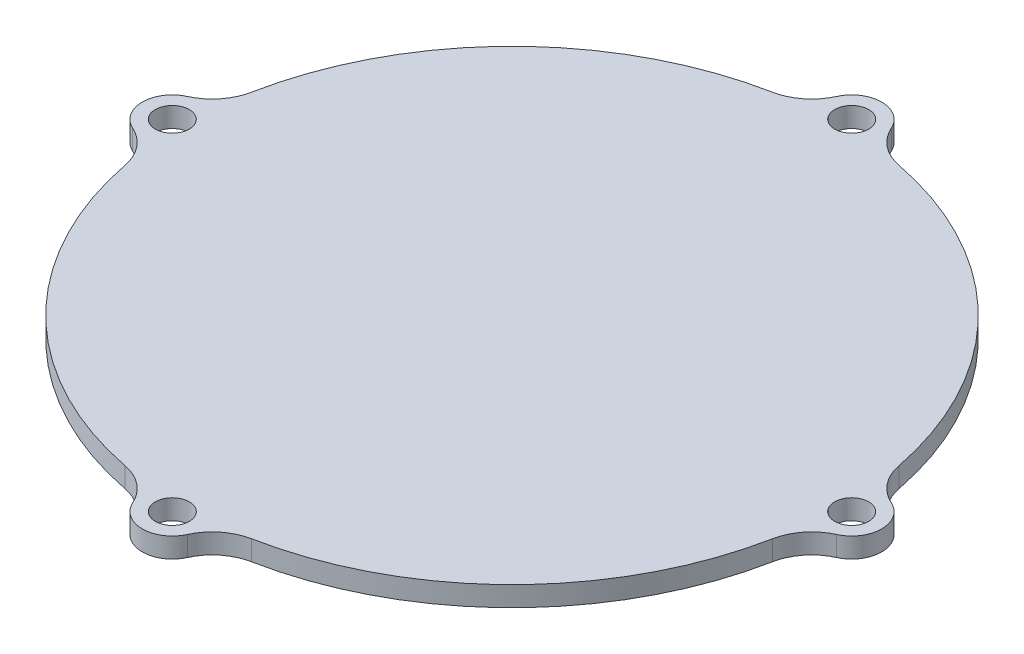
from build123d import *

# Parameters (mm, degrees)
SKETCH1_R                = 33
BOSS_EXTRUDE1_DEPTH      = 2
SKETCH2_R                = 3
BOSS_EXTRUDE2_DEPTH      = 2
FILLET1_R                = 5
CIRPATTERN1_COUNT        = 4
FILLET1_OF_CIRPATTERN1_R = 5
M3_CLEARANCE_HOLE1_D     = 3.4


with BuildPart() as part:
    # Sketch1 → Boss-Extrude1 (new body)
    with BuildSketch(Plane(origin=(0, 0, 0), x_dir=(1, 0, 0), z_dir=(0, 1, 0))):
        with Locations(Location((0, 0, 0), (0, 0, 270))):
            Circle(SKETCH1_R)
    extrude(amount=BOSS_EXTRUDE1_DEPTH)

    # Sketch2 → Boss-Extrude2 (add, through all)
    with BuildSketch(Plane(origin=(0, 2, 0), x_dir=(1, 0, 0), z_dir=(0, 1, 0))):
        with Locations((0, 34)):
            Circle(SKETCH2_R)
    boss_extrude2 = extrude(amount=-BOSS_EXTRUDE2_DEPTH)

    # Fillet1
    fillet1_edges = [part.edges().sort_by_distance(p)[0] for p in [
        (2.784037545, 1, -32.882352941),
        (-2.784037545, 1, -32.882352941),
    ]]
    fillet(fillet1_edges, radius=FILLET1_R)

    # CirPattern1: Boss-Extrude2 ×4 about axis
    cirpattern1_axis = Axis((0, 0, 0), (0, 1, 0))
    for i in range(1, CIRPATTERN1_COUNT):
        add(boss_extrude2.rotate(cirpattern1_axis, i * 360 / CIRPATTERN1_COUNT))

    # Fillet1 of CirPattern1
    fillet1_of_cirpattern1_edges = [part.edges().sort_by_distance(p)[0] for p in [
        (-32.882352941, 1, -2.784037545),
        (-32.882352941, 1, 2.784037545),
        (-2.784037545, 1, 32.882352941),
        (2.784037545, 1, 32.882352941),
        (32.882352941, 1, 2.784037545),
        (32.882352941, 1, -2.784037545),
    ]]
    fillet(fillet1_of_cirpattern1_edges, radius=FILLET1_OF_CIRPATTERN1_R)

    # M3 Clearance Hole1 (through all)
    with Locations(Plane(origin=(0, 2, 0), x_dir=(1, 0, 0), z_dir=(0, 1, 0))):
        with Locations((0, -34), (34, 0), (0, 34), (-34, 0)):
            Hole(M3_CLEARANCE_HOLE1_D / 2)


solid = part.part
